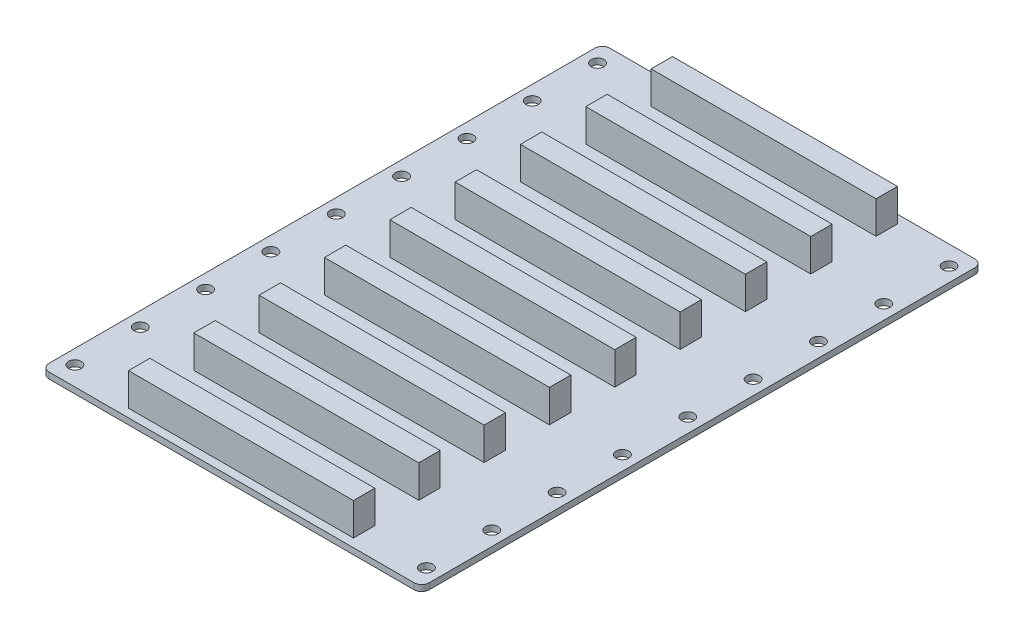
from build123d import *

# Parameters (mm, degrees)
SKETCH1_W           = 99.5
SKETCH1_H           = 146.8
BOSS_EXTRUDE1_DEPTH = 1.6
SKETCH3_R           = 1.65
CUT_EXTRUDE2_DEPTH  = 1.6
SKETCH4_W           = 58.89
SKETCH4_H           = 5.6
BOSS_EXTRUDE2_DEPTH = 8.5
FILLET2_R           = 2


with BuildPart() as part:
    # Sketch1 → Boss-Extrude1 (new body)
    with BuildSketch(Plane(origin=(0, 0, 0), x_dir=(1, 0, 0), z_dir=(0, 1, 0))):
        Rectangle(SKETCH1_W, SKETCH1_H)
    extrude(amount=BOSS_EXTRUDE1_DEPTH)

    # Sketch3 → Cut-Extrude2 (cut)
    with BuildSketch(Plane(origin=(0, 1.6, 0), x_dir=(1, 0, 0), z_dir=(0, 1, 0))):
        with Locations(Location((-46, -68.4, 0), (0, 0, 270))):
            Circle(SKETCH3_R)
        with Locations(Location((-46, -51.3, 0), (0, 0, 270))):
            Circle(SKETCH3_R)
        with Locations(Location((-46, -34.2, 0), (0, 0, 270))):
            Circle(SKETCH3_R)
        with Locations(Location((-46, -17.1, 0), (0, 0, 270))):
            Circle(SKETCH3_R)
        with Locations(Location((-46, 0, 0), (0, 0, 270))):
            Circle(SKETCH3_R)
        with Locations(Location((-46, 17.1, 0), (0, 0, 270))):
            Circle(SKETCH3_R)
        with Locations(Location((-46, 34.2, 0), (0, 0, 270))):
            Circle(SKETCH3_R)
        with Locations(Location((-46, 51.3, 0), (0, 0, 270))):
            Circle(SKETCH3_R)
        with Locations(Location((-46, 68.4, 0), (0, 0, 270))):
            Circle(SKETCH3_R)
        with Locations(Location((46, 68.4, 0), (0, 0, 90))):
            Circle(SKETCH3_R)
        with Locations(Location((46, 51.3, 0), (0, 0, 90))):
            Circle(SKETCH3_R)
        with Locations(Location((46, 34.2, 0), (0, 0, 90))):
            Circle(SKETCH3_R)
        with Locations(Location((46, 17.1, 0), (0, 0, 90))):
            Circle(SKETCH3_R)
        with Locations(Location((46, 0, 0), (0, 0, 90))):
            Circle(SKETCH3_R)
        with Locations(Location((46, -17.1, 0), (0, 0, 90))):
            Circle(SKETCH3_R)
        with Locations(Location((46, -34.2, 0), (0, 0, 90))):
            Circle(SKETCH3_R)
        with Locations(Location((46, -51.3, 0), (0, 0, 90))):
            Circle(SKETCH3_R)
        with Locations(Location((46, -68.4, 0), (0, 0, 90))):
            Circle(SKETCH3_R)
    extrude(amount=-CUT_EXTRUDE2_DEPTH, mode=Mode.SUBTRACT)

    # Sketch4 → Boss-Extrude2 (add)
    with BuildSketch(Plane(origin=(0, 1.6, 0), x_dir=(1, 0, 0), z_dir=(0, 1, 0))):
        with Locations((0.25, -51.3)):
            Rectangle(SKETCH4_W, SKETCH4_H)
        with Locations((0.25, -68.4)):
            Rectangle(SKETCH4_W, SKETCH4_H)
        with Locations((0.25, -34.2)):
            Rectangle(SKETCH4_W, SKETCH4_H)
        with Locations((0.25, -17.1)):
            Rectangle(SKETCH4_W, SKETCH4_H)
        with Locations((0.25, 0)):
            Rectangle(SKETCH4_W, SKETCH4_H)
        with Locations((0.25, 17.1)):
            Rectangle(SKETCH4_W, SKETCH4_H)
        with Locations((0.25, 34.2)):
            Rectangle(SKETCH4_W, SKETCH4_H)
        with Locations((0.25, 51.3)):
            Rectangle(SKETCH4_W, SKETCH4_H)
        with Locations((0.25, 68.4)):
            Rectangle(SKETCH4_W, SKETCH4_H)
    extrude(amount=BOSS_EXTRUDE2_DEPTH)

    # Fillet2
    fillet2_edges = [part.edges().sort_by_distance(p)[0] for p in [
        (49.75, 0.8, 73.4),
        (-49.75, 0.8, 73.4),
        (-49.75, 0.8, -73.4),
        (49.75, 0.8, -73.4),
    ]]
    fillet(fillet2_edges, radius=FILLET2_R)


solid = part.part
